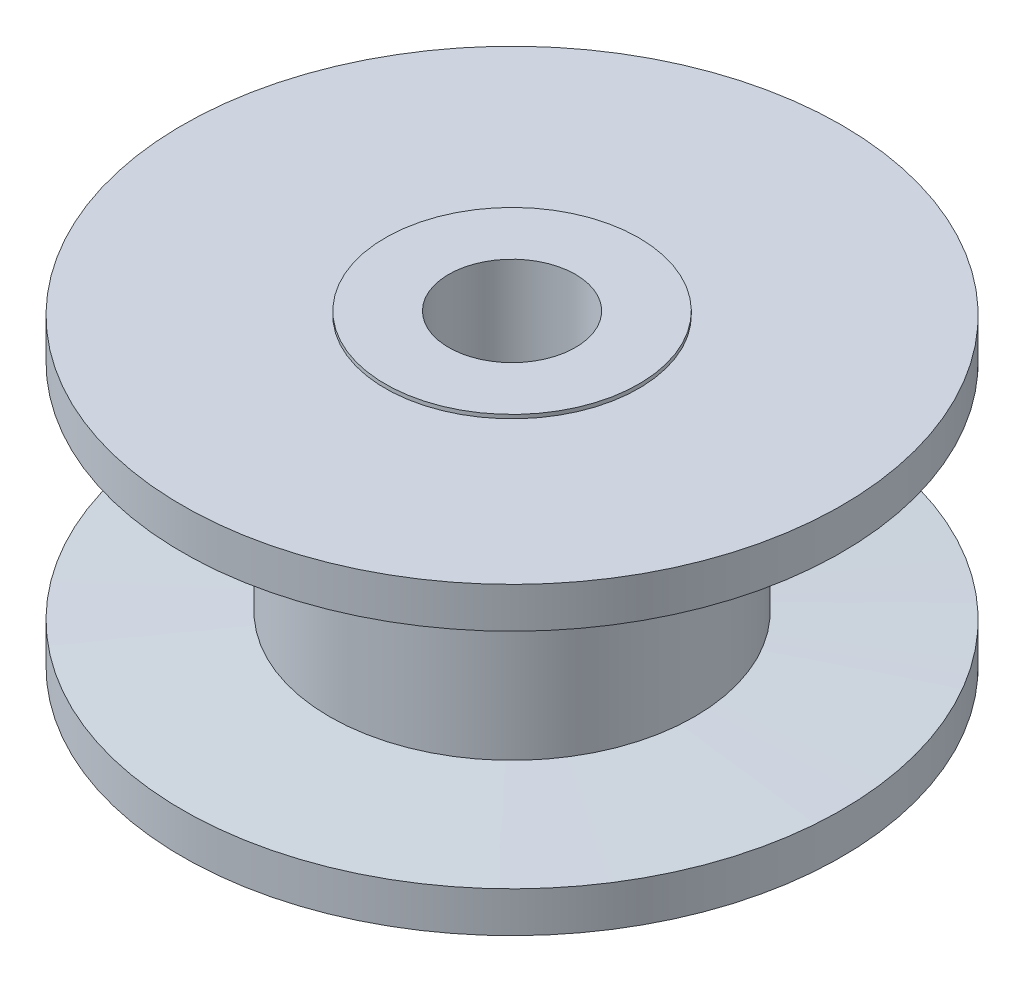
ISO-10303-21;
HEADER;
FILE_DESCRIPTION(('STEP AP214'),'2;1');
FILE_NAME('part.step','',(''),(''),'','','');
FILE_SCHEMA(('AUTOMOTIVE_DESIGN { 1 0 10303 214 1 1 1 1 }'));
ENDSEC;
DATA;
#1=APPLICATION_CONTEXT('core data for automotive mechanical design processes');
#2=APPLICATION_PROTOCOL_DEFINITION('international standard','automotive_design',2000,#1);
#3=PRODUCT_CONTEXT('',#1,'mechanical');
#4=PRODUCT('Part','Part','',(#3));
#5=PRODUCT_RELATED_PRODUCT_CATEGORY('part','',(#4));
#6=PRODUCT_DEFINITION_FORMATION('','',#4);
#7=PRODUCT_DEFINITION_CONTEXT('part definition',#1,'design');
#8=PRODUCT_DEFINITION('design','',#6,#7);
#9=PRODUCT_DEFINITION_SHAPE('','',#8);
#10=(LENGTH_UNIT() NAMED_UNIT(*) SI_UNIT(.MILLI.,.METRE.));
#11=(NAMED_UNIT(*) PLANE_ANGLE_UNIT() SI_UNIT($,.RADIAN.));
#12=(NAMED_UNIT(*) SI_UNIT($,.STERADIAN.) SOLID_ANGLE_UNIT());
#13=UNCERTAINTY_MEASURE_WITH_UNIT(LENGTH_MEASURE(1.E-05),#10,'distance_accuracy_value','');
#14=(GEOMETRIC_REPRESENTATION_CONTEXT(3) GLOBAL_UNCERTAINTY_ASSIGNED_CONTEXT((#13)) GLOBAL_UNIT_ASSIGNED_CONTEXT((#10,
#11,#12)) REPRESENTATION_CONTEXT('',''));
#15=CARTESIAN_POINT('',(0.,0.,0.));
#16=DIRECTION('',(0.,0.,1.));
#17=DIRECTION('',(1.,0.,0.));
#18=AXIS2_PLACEMENT_3D('',#15,#16,#17);
#19=CARTESIAN_POINT('',(25.,0.,0.));
#20=DIRECTION('',(0.,-1.,0.));
#21=DIRECTION('',(0.,0.,-1.));
#22=AXIS2_PLACEMENT_3D('',#19,#20,#21);
#23=PLANE('',#22);
#24=CARTESIAN_POINT('',(0.,-1.66533453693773E-13,0.));
#25=DIRECTION('',(0.,-1.,0.));
#26=DIRECTION('',(0.,0.,-1.));
#27=AXIS2_PLACEMENT_3D('',#24,#25,#26);
#28=CIRCLE('',#27,25.);
#29=CARTESIAN_POINT('',(0.,-1.66533453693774E-13,-25.));
#30=VERTEX_POINT('',#29);
#31=EDGE_CURVE('E10',#30,#30,#28,.T.);
#32=ORIENTED_EDGE('',*,*,#31,.T.);
#33=EDGE_LOOP('',(#32));
#34=FACE_BOUND('',#33,.T.);
#35=CARTESIAN_POINT('',(0.,-1.66533453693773E-13,0.));
#36=DIRECTION('',(0.,-1.,0.));
#37=DIRECTION('',(0.,0.,-1.));
#38=AXIS2_PLACEMENT_3D('',#35,#36,#37);
#39=CIRCLE('',#38,12.5);
#40=CARTESIAN_POINT('',(0.,-1.66533453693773E-13,-12.5));
#41=VERTEX_POINT('',#40);
#42=EDGE_CURVE('E87',#41,#41,#39,.T.);
#43=ORIENTED_EDGE('',*,*,#42,.F.);
#44=EDGE_LOOP('',(#43));
#45=FACE_BOUND('',#44,.T.);
#46=ADVANCED_FACE('F36',(#34,#45),#23,.T.);
#47=CARTESIAN_POINT('',(0.,-1.66533453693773E-13,0.));
#48=DIRECTION('',(0.,-1.,0.));
#49=DIRECTION('',(0.,0.,-1.));
#50=AXIS2_PLACEMENT_3D('',#47,#48,#49);
#51=CYLINDRICAL_SURFACE('',#50,25.);
#52=CARTESIAN_POINT('',(0.,0.749999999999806,0.));
#53=DIRECTION('',(0.,-1.,0.));
#54=DIRECTION('',(0.,0.,-1.));
#55=AXIS2_PLACEMENT_3D('',#52,#53,#54);
#56=CIRCLE('',#55,25.);
#57=CARTESIAN_POINT('',(0.,0.749999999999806,-25.));
#58=VERTEX_POINT('',#57);
#59=EDGE_CURVE('E43',#58,#58,#56,.T.);
#60=ORIENTED_EDGE('',*,*,#59,.T.);
#61=EDGE_LOOP('',(#60));
#62=FACE_BOUND('',#61,.T.);
#63=ORIENTED_EDGE('',*,*,#31,.F.);
#64=EDGE_LOOP('',(#63));
#65=FACE_BOUND('',#64,.T.);
#66=ADVANCED_FACE('F96',(#62,#65),#51,.T.);
#67=CARTESIAN_POINT('',(65.0000000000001,0.749999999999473,0.));
#68=DIRECTION('',(0.,-1.,0.));
#69=DIRECTION('',(0.,0.,-1.));
#70=AXIS2_PLACEMENT_3D('',#67,#68,#69);
#71=PLANE('',#70);
#72=CARTESIAN_POINT('',(0.,0.749999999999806,0.));
#73=DIRECTION('',(0.,-1.,0.));
#74=DIRECTION('',(0.,0.,-1.));
#75=AXIS2_PLACEMENT_3D('',#72,#73,#74);
#76=CIRCLE('',#75,65.);
#77=CARTESIAN_POINT('',(0.,0.749999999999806,-65.0000000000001));
#78=VERTEX_POINT('',#77);
#79=EDGE_CURVE('E50',#78,#78,#76,.T.);
#80=ORIENTED_EDGE('',*,*,#79,.T.);
#81=EDGE_LOOP('',(#80));
#82=FACE_BOUND('',#81,.T.);
#83=ORIENTED_EDGE('',*,*,#59,.F.);
#84=EDGE_LOOP('',(#83));
#85=FACE_BOUND('',#84,.T.);
#86=ADVANCED_FACE('F100',(#82,#85),#71,.T.);
#87=CARTESIAN_POINT('',(0.,-1.66533453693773E-13,0.));
#88=DIRECTION('',(0.,-1.,0.));
#89=DIRECTION('',(0.,0.,-1.));
#90=AXIS2_PLACEMENT_3D('',#87,#88,#89);
#91=CYLINDRICAL_SURFACE('',#90,65.);
#92=CARTESIAN_POINT('',(0.,8.74999999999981,0.));
#93=DIRECTION('',(0.,-1.,0.));
#94=DIRECTION('',(0.,0.,-1.));
#95=AXIS2_PLACEMENT_3D('',#92,#93,#94);
#96=CIRCLE('',#95,65.);
#97=CARTESIAN_POINT('',(0.,8.74999999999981,-65.0000000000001));
#98=VERTEX_POINT('',#97);
#99=EDGE_CURVE('E56',#98,#98,#96,.T.);
#100=ORIENTED_EDGE('',*,*,#99,.T.);
#101=EDGE_LOOP('',(#100));
#102=FACE_BOUND('',#101,.T.);
#103=ORIENTED_EDGE('',*,*,#79,.F.);
#104=EDGE_LOOP('',(#103));
#105=FACE_BOUND('',#104,.T.);
#106=ADVANCED_FACE('F104',(#102,#105),#91,.T.);
#107=CARTESIAN_POINT('',(0.,8.74999999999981,0.));
#108=DIRECTION('',(0.,-1.,0.));
#109=DIRECTION('',(0.,0.,-1.));
#110=AXIS2_PLACEMENT_3D('',#107,#108,#109);
#111=CONICAL_SURFACE('',#110,65.,1.52118190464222);
#112=CARTESIAN_POINT('',(0.,10.1899999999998,0.));
#113=DIRECTION('',(0.,-1.,0.));
#114=DIRECTION('',(0.,0.,-1.));
#115=AXIS2_PLACEMENT_3D('',#112,#113,#114);
#116=CIRCLE('',#115,36.);
#117=CARTESIAN_POINT('',(0.,10.1899999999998,-36.));
#118=VERTEX_POINT('',#117);
#119=EDGE_CURVE('E62',#118,#118,#116,.T.);
#120=ORIENTED_EDGE('',*,*,#119,.T.);
#121=EDGE_LOOP('',(#120));
#122=FACE_BOUND('',#121,.T.);
#123=ORIENTED_EDGE('',*,*,#99,.F.);
#124=EDGE_LOOP('',(#123));
#125=FACE_BOUND('',#124,.T.);
#126=ADVANCED_FACE('F111',(#122,#125),#111,.T.);
#127=CARTESIAN_POINT('',(0.,-1.66533453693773E-13,0.));
#128=DIRECTION('',(0.,-1.,0.));
#129=DIRECTION('',(0.,0.,-1.));
#130=AXIS2_PLACEMENT_3D('',#127,#128,#129);
#131=CYLINDRICAL_SURFACE('',#130,36.);
#132=CARTESIAN_POINT('',(1.11022302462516E-13,51.2999999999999,0.));
#133=DIRECTION('',(0.,-1.,0.));
#134=DIRECTION('',(0.,0.,-1.));
#135=AXIS2_PLACEMENT_3D('',#132,#133,#134);
#136=CIRCLE('',#135,36.);
#137=CARTESIAN_POINT('',(1.11022302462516E-13,51.2999999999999,-36.));
#138=VERTEX_POINT('',#137);
#139=EDGE_CURVE('E65',#138,#138,#136,.T.);
#140=ORIENTED_EDGE('',*,*,#139,.T.);
#141=EDGE_LOOP('',(#140));
#142=FACE_BOUND('',#141,.T.);
#143=ORIENTED_EDGE('',*,*,#119,.F.);
#144=EDGE_LOOP('',(#143));
#145=FACE_BOUND('',#144,.T.);
#146=ADVANCED_FACE('F115',(#142,#145),#131,.T.);
#147=CARTESIAN_POINT('',(1.11022302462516E-13,51.2999999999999,0.));
#148=DIRECTION('',(0.,1.,0.));
#149=DIRECTION('',(0.,0.,1.));
#150=AXIS2_PLACEMENT_3D('',#147,#148,#149);
#151=CONICAL_SURFACE('',#150,36.,1.52083793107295);
#152=CARTESIAN_POINT('',(1.11022302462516E-13,52.7499999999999,0.));
#153=DIRECTION('',(0.,-1.,0.));
#154=DIRECTION('',(0.,0.,-1.));
#155=AXIS2_PLACEMENT_3D('',#152,#153,#154);
#156=CIRCLE('',#155,65.);
#157=CARTESIAN_POINT('',(1.11022302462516E-13,52.7499999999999,-65.0000000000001));
#158=VERTEX_POINT('',#157);
#159=EDGE_CURVE('E69',#158,#158,#156,.T.);
#160=ORIENTED_EDGE('',*,*,#159,.T.);
#161=EDGE_LOOP('',(#160));
#162=FACE_BOUND('',#161,.T.);
#163=ORIENTED_EDGE('',*,*,#139,.F.);
#164=EDGE_LOOP('',(#163));
#165=FACE_BOUND('',#164,.T.);
#166=ADVANCED_FACE('F119',(#162,#165),#151,.T.);
#167=CARTESIAN_POINT('',(0.,-1.66533453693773E-13,0.));
#168=DIRECTION('',(0.,-1.,0.));
#169=DIRECTION('',(0.,0.,-1.));
#170=AXIS2_PLACEMENT_3D('',#167,#168,#169);
#171=CYLINDRICAL_SURFACE('',#170,65.);
#172=CARTESIAN_POINT('',(3.33066907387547E-13,60.7499999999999,0.));
#173=DIRECTION('',(0.,-1.,0.));
#174=DIRECTION('',(0.,0.,-1.));
#175=AXIS2_PLACEMENT_3D('',#172,#173,#174);
#176=CIRCLE('',#175,65.);
#177=CARTESIAN_POINT('',(3.33066907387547E-13,60.7499999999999,-65.0000000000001));
#178=VERTEX_POINT('',#177);
#179=EDGE_CURVE('E73',#178,#178,#176,.T.);
#180=ORIENTED_EDGE('',*,*,#179,.T.);
#181=EDGE_LOOP('',(#180));
#182=FACE_BOUND('',#181,.T.);
#183=ORIENTED_EDGE('',*,*,#159,.F.);
#184=EDGE_LOOP('',(#183));
#185=FACE_BOUND('',#184,.T.);
#186=ADVANCED_FACE('F123',(#182,#185),#171,.T.);
#187=CARTESIAN_POINT('',(25.,60.7499999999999,0.));
#188=DIRECTION('',(0.,1.,0.));
#189=DIRECTION('',(0.,0.,1.));
#190=AXIS2_PLACEMENT_3D('',#187,#188,#189);
#191=PLANE('',#190);
#192=CARTESIAN_POINT('',(3.33066907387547E-13,60.7499999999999,0.));
#193=DIRECTION('',(0.,-1.,0.));
#194=DIRECTION('',(0.,0.,-1.));
#195=AXIS2_PLACEMENT_3D('',#192,#193,#194);
#196=CIRCLE('',#195,25.);
#197=CARTESIAN_POINT('',(3.33066907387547E-13,60.7499999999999,-25.));
#198=VERTEX_POINT('',#197);
#199=EDGE_CURVE('E76',#198,#198,#196,.T.);
#200=ORIENTED_EDGE('',*,*,#199,.T.);
#201=EDGE_LOOP('',(#200));
#202=FACE_BOUND('',#201,.T.);
#203=ORIENTED_EDGE('',*,*,#179,.F.);
#204=EDGE_LOOP('',(#203));
#205=FACE_BOUND('',#204,.T.);
#206=ADVANCED_FACE('F127',(#202,#205),#191,.T.);
#207=CARTESIAN_POINT('',(0.,-1.66533453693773E-13,0.));
#208=DIRECTION('',(0.,-1.,0.));
#209=DIRECTION('',(0.,0.,-1.));
#210=AXIS2_PLACEMENT_3D('',#207,#208,#209);
#211=CYLINDRICAL_SURFACE('',#210,25.);
#212=CARTESIAN_POINT('',(3.33066907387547E-13,61.4999999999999,0.));
#213=DIRECTION('',(0.,-1.,0.));
#214=DIRECTION('',(0.,0.,-1.));
#215=AXIS2_PLACEMENT_3D('',#212,#213,#214);
#216=CIRCLE('',#215,25.);
#217=CARTESIAN_POINT('',(3.33066907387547E-13,61.4999999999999,-25.));
#218=VERTEX_POINT('',#217);
#219=EDGE_CURVE('E80',#218,#218,#216,.T.);
#220=ORIENTED_EDGE('',*,*,#219,.T.);
#221=EDGE_LOOP('',(#220));
#222=FACE_BOUND('',#221,.T.);
#223=ORIENTED_EDGE('',*,*,#199,.F.);
#224=EDGE_LOOP('',(#223));
#225=FACE_BOUND('',#224,.T.);
#226=ADVANCED_FACE('F131',(#222,#225),#211,.T.);
#227=CARTESIAN_POINT('',(12.5000000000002,61.4999999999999,-2.22044604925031E-13));
#228=DIRECTION('',(0.,1.,0.));
#229=DIRECTION('',(0.,0.,1.));
#230=AXIS2_PLACEMENT_3D('',#227,#228,#229);
#231=PLANE('',#230);
#232=CARTESIAN_POINT('',(3.33066907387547E-13,61.4999999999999,0.));
#233=DIRECTION('',(0.,-1.,0.));
#234=DIRECTION('',(0.,0.,-1.));
#235=AXIS2_PLACEMENT_3D('',#232,#233,#234);
#236=CIRCLE('',#235,12.5);
#237=CARTESIAN_POINT('',(3.33066907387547E-13,61.4999999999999,-12.5));
#238=VERTEX_POINT('',#237);
#239=EDGE_CURVE('E84',#238,#238,#236,.T.);
#240=ORIENTED_EDGE('',*,*,#239,.T.);
#241=EDGE_LOOP('',(#240));
#242=FACE_BOUND('',#241,.T.);
#243=ORIENTED_EDGE('',*,*,#219,.F.);
#244=EDGE_LOOP('',(#243));
#245=FACE_BOUND('',#244,.T.);
#246=ADVANCED_FACE('F135',(#242,#245),#231,.T.);
#247=CARTESIAN_POINT('',(0.,-1.66533453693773E-13,0.));
#248=DIRECTION('',(0.,-1.,0.));
#249=DIRECTION('',(0.,0.,-1.));
#250=AXIS2_PLACEMENT_3D('',#247,#248,#249);
#251=CYLINDRICAL_SURFACE('',#250,12.5);
#252=ORIENTED_EDGE('',*,*,#42,.T.);
#253=EDGE_LOOP('',(#252));
#254=FACE_BOUND('',#253,.T.);
#255=ORIENTED_EDGE('',*,*,#239,.F.);
#256=EDGE_LOOP('',(#255));
#257=FACE_BOUND('',#256,.T.);
#258=ADVANCED_FACE('F92',(#254,#257),#251,.F.);
#259=CLOSED_SHELL('',(#46,#66,#86,#106,#126,#146,#166,#186,#206,#226,#246,#258));
#260=MANIFOLD_SOLID_BREP('B2',#259);
#261=ADVANCED_BREP_SHAPE_REPRESENTATION('',(#18,#260),#14);
#262=SHAPE_DEFINITION_REPRESENTATION(#9,#261);
ENDSEC;
END-ISO-10303-21;
